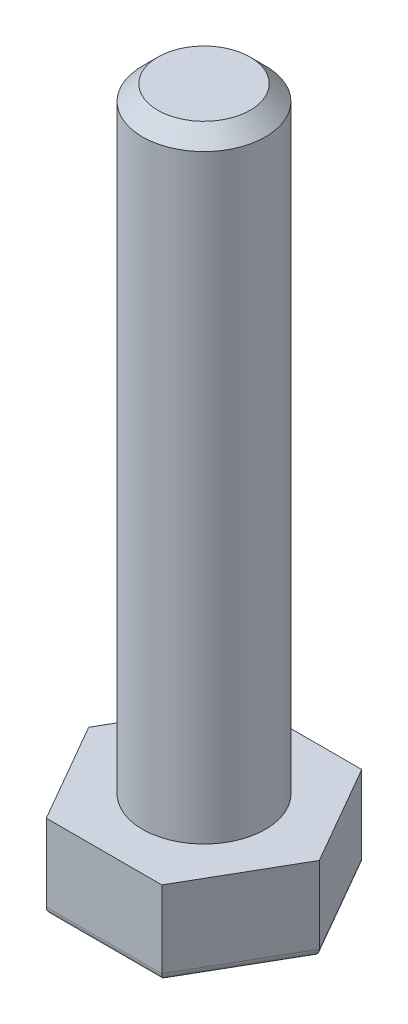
from build123d import *

# Parameters (mm, degrees)
EXTRUSION1_DEPTH = 5.5
CONG_1_R         = 0.5
ESQUISSE2_R      = 4
EXTRUSION2_DEPTH = 40
CHANFREIN1_SIZE  = 1


with BuildPart() as part:
    # Esquisse1 → Extrusion1 (new body)
    with BuildSketch(Plane(origin=(0, 0, 0), x_dir=(1, 0, 0), z_dir=(0, 1, 0))):
        Polygon((-3.758342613, 6.5), (3.758342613, 6.5), (7.5, 0), (3.758342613, -6.5), (-3.758342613, -6.5), (-7.5, 0), align=None)
    extrude(amount=EXTRUSION1_DEPTH)

    # Cong_1
    cong_1_edges = [part.edges().sort_by_distance(p)[0] for p in [
        (-5.629171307, 0, 3.25),
        (-5.629171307, 0, -3.25),
        (0, 0, -6.5),
        (5.629171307, 0, -3.25),
        (5.629171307, 0, 3.25),
        (0, 0, 6.5),
    ]]
    fillet(cong_1_edges, radius=CONG_1_R)

    # Esquisse2 → Extrusion2 (add)
    with BuildSketch(Plane(origin=(0, 5.5, 0), x_dir=(-1, 0, 0), z_dir=(0, 1, 0))):
        with Locations(Location((0, 0, 0), (0, 0, 90))):
            Circle(ESQUISSE2_R)
    extrude(amount=EXTRUSION2_DEPTH)

    # Chanfrein1
    chanfrein1_edges = [part.edges().sort_by_distance(p)[0] for p in [
        (0, 45.5, -4),
    ]]
    chamfer(chanfrein1_edges, length=CHANFREIN1_SIZE)


solid = part.part
